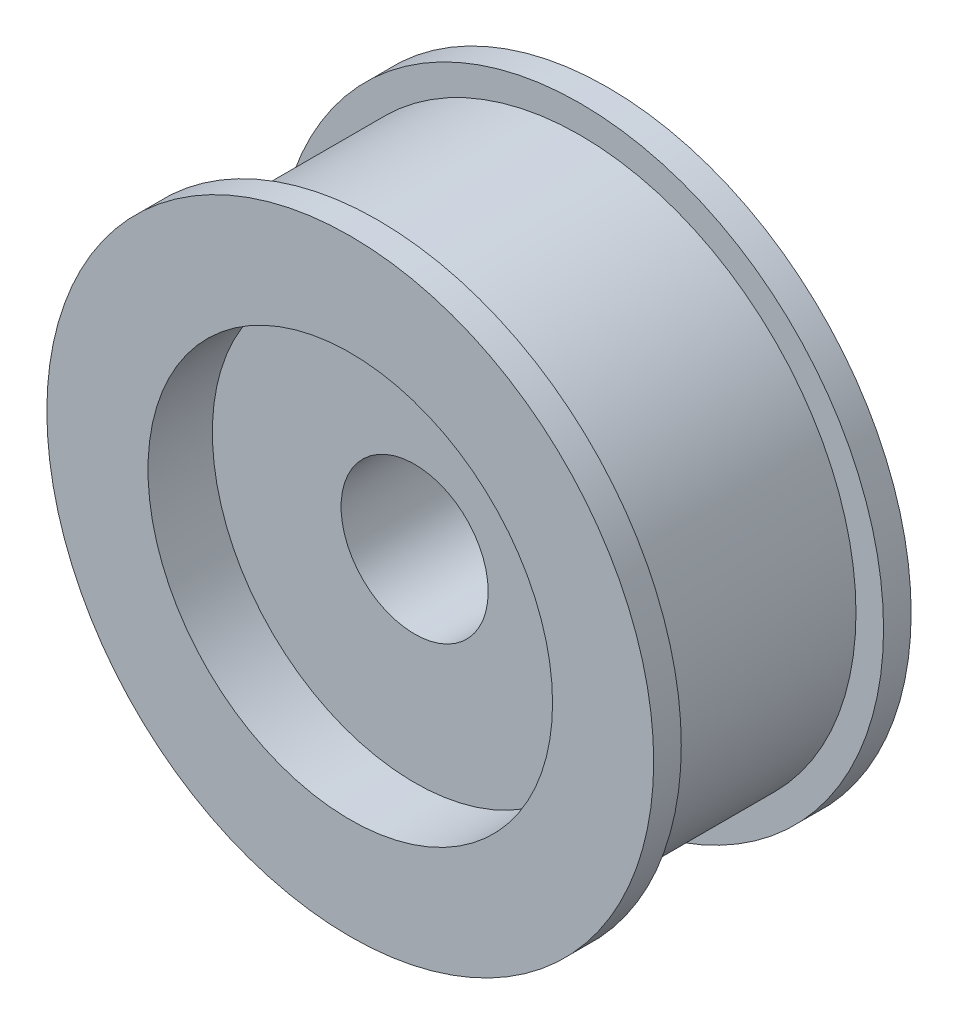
ISO-10303-21;
HEADER;
FILE_DESCRIPTION(('STEP AP214'),'2;1');
FILE_NAME('part.step','',(''),(''),'','','');
FILE_SCHEMA(('AUTOMOTIVE_DESIGN { 1 0 10303 214 1 1 1 1 }'));
ENDSEC;
DATA;
#1=APPLICATION_CONTEXT('core data for automotive mechanical design processes');
#2=APPLICATION_PROTOCOL_DEFINITION('international standard','automotive_design',2000,#1);
#3=PRODUCT_CONTEXT('',#1,'mechanical');
#4=PRODUCT('Part','Part','',(#3));
#5=PRODUCT_RELATED_PRODUCT_CATEGORY('part','',(#4));
#6=PRODUCT_DEFINITION_FORMATION('','',#4);
#7=PRODUCT_DEFINITION_CONTEXT('part definition',#1,'design');
#8=PRODUCT_DEFINITION('design','',#6,#7);
#9=PRODUCT_DEFINITION_SHAPE('','',#8);
#10=(LENGTH_UNIT() NAMED_UNIT(*) SI_UNIT(.MILLI.,.METRE.));
#11=(NAMED_UNIT(*) PLANE_ANGLE_UNIT() SI_UNIT($,.RADIAN.));
#12=(NAMED_UNIT(*) SI_UNIT($,.STERADIAN.) SOLID_ANGLE_UNIT());
#13=UNCERTAINTY_MEASURE_WITH_UNIT(LENGTH_MEASURE(1.E-05),#10,'distance_accuracy_value','');
#14=(GEOMETRIC_REPRESENTATION_CONTEXT(3) GLOBAL_UNCERTAINTY_ASSIGNED_CONTEXT((#13)) GLOBAL_UNIT_ASSIGNED_CONTEXT((#10,
#11,#12)) REPRESENTATION_CONTEXT('',''));
#15=CARTESIAN_POINT('',(0.,0.,0.));
#16=DIRECTION('',(0.,0.,1.));
#17=DIRECTION('',(1.,0.,0.));
#18=AXIS2_PLACEMENT_3D('',#15,#16,#17);
#19=CARTESIAN_POINT('',(0.,0.,23.3646380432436));
#20=DIRECTION('',(0.,0.,1.));
#21=DIRECTION('',(1.,0.,0.));
#22=AXIS2_PLACEMENT_3D('',#19,#20,#21);
#23=CYLINDRICAL_SURFACE('',#22,9.);
#24=CARTESIAN_POINT('',(0.,0.,-7.));
#25=DIRECTION('',(0.,0.,1.));
#26=DIRECTION('',(1.,0.,0.));
#27=AXIS2_PLACEMENT_3D('',#24,#25,#26);
#28=CIRCLE('',#27,9.);
#29=CARTESIAN_POINT('',(9.,0.,-7.));
#30=VERTEX_POINT('',#29);
#31=EDGE_CURVE('E52',#30,#30,#28,.T.);
#32=ORIENTED_EDGE('',*,*,#31,.F.);
#33=EDGE_LOOP('',(#32));
#34=FACE_BOUND('',#33,.T.);
#35=CARTESIAN_POINT('',(0.,0.,-3.5));
#36=DIRECTION('',(0.,0.,1.));
#37=DIRECTION('',(1.,0.,0.));
#38=AXIS2_PLACEMENT_3D('',#35,#36,#37);
#39=CIRCLE('',#38,9.);
#40=CARTESIAN_POINT('',(9.,0.,-3.5));
#41=VERTEX_POINT('',#40);
#42=EDGE_CURVE('E8',#41,#41,#39,.T.);
#43=ORIENTED_EDGE('',*,*,#42,.T.);
#44=EDGE_LOOP('',(#43));
#45=FACE_BOUND('',#44,.T.);
#46=ADVANCED_FACE('F12',(#34,#45),#23,.F.);
#47=CARTESIAN_POINT('',(0.,4.,-3.5));
#48=DIRECTION('',(0.,0.,1.));
#49=DIRECTION('',(1.,0.,0.));
#50=AXIS2_PLACEMENT_3D('',#47,#48,#49);
#51=PLANE('',#50);
#52=ORIENTED_EDGE('',*,*,#42,.F.);
#53=EDGE_LOOP('',(#52));
#54=FACE_BOUND('',#53,.T.);
#55=CARTESIAN_POINT('',(0.,0.,-3.5));
#56=DIRECTION('',(0.,0.,1.));
#57=DIRECTION('',(1.,0.,0.));
#58=AXIS2_PLACEMENT_3D('',#55,#56,#57);
#59=CIRCLE('',#58,4.);
#60=CARTESIAN_POINT('',(4.,0.,-3.5));
#61=VERTEX_POINT('',#60);
#62=EDGE_CURVE('E18',#61,#61,#59,.T.);
#63=ORIENTED_EDGE('',*,*,#62,.T.);
#64=EDGE_LOOP('',(#63));
#65=FACE_BOUND('',#64,.T.);
#66=ADVANCED_FACE('F59',(#54,#65),#51,.F.);
#67=CARTESIAN_POINT('',(0.,0.,23.3646380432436));
#68=DIRECTION('',(0.,0.,1.));
#69=DIRECTION('',(1.,0.,0.));
#70=AXIS2_PLACEMENT_3D('',#67,#68,#69);
#71=CYLINDRICAL_SURFACE('',#70,4.);
#72=ORIENTED_EDGE('',*,*,#62,.F.);
#73=EDGE_LOOP('',(#72));
#74=FACE_BOUND('',#73,.T.);
#75=CARTESIAN_POINT('',(0.,0.,3.5));
#76=DIRECTION('',(0.,0.,1.));
#77=DIRECTION('',(1.,0.,0.));
#78=AXIS2_PLACEMENT_3D('',#75,#76,#77);
#79=CIRCLE('',#78,4.);
#80=CARTESIAN_POINT('',(4.,0.,3.5));
#81=VERTEX_POINT('',#80);
#82=EDGE_CURVE('E22',#81,#81,#79,.T.);
#83=ORIENTED_EDGE('',*,*,#82,.T.);
#84=EDGE_LOOP('',(#83));
#85=FACE_BOUND('',#84,.T.);
#86=ADVANCED_FACE('F65',(#74,#85),#71,.F.);
#87=CARTESIAN_POINT('',(0.,11.,3.5));
#88=DIRECTION('',(0.,0.,-1.));
#89=DIRECTION('',(-1.,0.,0.));
#90=AXIS2_PLACEMENT_3D('',#87,#88,#89);
#91=PLANE('',#90);
#92=ORIENTED_EDGE('',*,*,#82,.F.);
#93=EDGE_LOOP('',(#92));
#94=FACE_BOUND('',#93,.T.);
#95=CARTESIAN_POINT('',(0.,0.,3.5));
#96=DIRECTION('',(0.,0.,1.));
#97=DIRECTION('',(1.,0.,0.));
#98=AXIS2_PLACEMENT_3D('',#95,#96,#97);
#99=CIRCLE('',#98,11.);
#100=CARTESIAN_POINT('',(11.,0.,3.5));
#101=VERTEX_POINT('',#100);
#102=EDGE_CURVE('E26',#101,#101,#99,.T.);
#103=ORIENTED_EDGE('',*,*,#102,.T.);
#104=EDGE_LOOP('',(#103));
#105=FACE_BOUND('',#104,.T.);
#106=ADVANCED_FACE('F71',(#94,#105),#91,.F.);
#107=CARTESIAN_POINT('',(0.,0.,23.3646380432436));
#108=DIRECTION('',(0.,0.,1.));
#109=DIRECTION('',(1.,0.,0.));
#110=AXIS2_PLACEMENT_3D('',#107,#108,#109);
#111=CYLINDRICAL_SURFACE('',#110,11.);
#112=ORIENTED_EDGE('',*,*,#102,.F.);
#113=EDGE_LOOP('',(#112));
#114=FACE_BOUND('',#113,.T.);
#115=CARTESIAN_POINT('',(0.,0.,7.));
#116=DIRECTION('',(0.,0.,1.));
#117=DIRECTION('',(1.,0.,0.));
#118=AXIS2_PLACEMENT_3D('',#115,#116,#117);
#119=CIRCLE('',#118,11.);
#120=CARTESIAN_POINT('',(11.,0.,7.));
#121=VERTEX_POINT('',#120);
#122=EDGE_CURVE('E31',#121,#121,#119,.T.);
#123=ORIENTED_EDGE('',*,*,#122,.T.);
#124=EDGE_LOOP('',(#123));
#125=FACE_BOUND('',#124,.T.);
#126=ADVANCED_FACE('F77',(#114,#125),#111,.F.);
#127=CARTESIAN_POINT('',(0.,16.5,7.));
#128=DIRECTION('',(0.,0.,-1.));
#129=DIRECTION('',(-1.,0.,0.));
#130=AXIS2_PLACEMENT_3D('',#127,#128,#129);
#131=PLANE('',#130);
#132=ORIENTED_EDGE('',*,*,#122,.F.);
#133=EDGE_LOOP('',(#132));
#134=FACE_BOUND('',#133,.T.);
#135=CARTESIAN_POINT('',(0.,0.,7.));
#136=DIRECTION('',(0.,0.,1.));
#137=DIRECTION('',(1.,0.,0.));
#138=AXIS2_PLACEMENT_3D('',#135,#136,#137);
#139=CIRCLE('',#138,16.5);
#140=CARTESIAN_POINT('',(16.5,0.,7.));
#141=VERTEX_POINT('',#140);
#142=EDGE_CURVE('E34',#141,#141,#139,.T.);
#143=ORIENTED_EDGE('',*,*,#142,.T.);
#144=EDGE_LOOP('',(#143));
#145=FACE_BOUND('',#144,.T.);
#146=ADVANCED_FACE('F81',(#134,#145),#131,.F.);
#147=CARTESIAN_POINT('',(0.,0.,23.3646380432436));
#148=DIRECTION('',(0.,0.,1.));
#149=DIRECTION('',(1.,0.,0.));
#150=AXIS2_PLACEMENT_3D('',#147,#148,#149);
#151=CYLINDRICAL_SURFACE('',#150,16.5);
#152=ORIENTED_EDGE('',*,*,#142,.F.);
#153=EDGE_LOOP('',(#152));
#154=FACE_BOUND('',#153,.T.);
#155=CARTESIAN_POINT('',(0.,0.,5.5));
#156=DIRECTION('',(0.,0.,1.));
#157=DIRECTION('',(1.,0.,0.));
#158=AXIS2_PLACEMENT_3D('',#155,#156,#157);
#159=CIRCLE('',#158,16.5);
#160=CARTESIAN_POINT('',(16.5,0.,5.5));
#161=VERTEX_POINT('',#160);
#162=EDGE_CURVE('E37',#161,#161,#159,.T.);
#163=ORIENTED_EDGE('',*,*,#162,.T.);
#164=EDGE_LOOP('',(#163));
#165=FACE_BOUND('',#164,.T.);
#166=ADVANCED_FACE('F85',(#154,#165),#151,.T.);
#167=CARTESIAN_POINT('',(0.,15.,5.5));
#168=DIRECTION('',(0.,0.,1.));
#169=DIRECTION('',(1.,0.,0.));
#170=AXIS2_PLACEMENT_3D('',#167,#168,#169);
#171=PLANE('',#170);
#172=ORIENTED_EDGE('',*,*,#162,.F.);
#173=EDGE_LOOP('',(#172));
#174=FACE_BOUND('',#173,.T.);
#175=CARTESIAN_POINT('',(0.,0.,5.5));
#176=DIRECTION('',(0.,0.,1.));
#177=DIRECTION('',(1.,0.,0.));
#178=AXIS2_PLACEMENT_3D('',#175,#176,#177);
#179=CIRCLE('',#178,15.);
#180=CARTESIAN_POINT('',(15.,0.,5.5));
#181=VERTEX_POINT('',#180);
#182=EDGE_CURVE('E40',#181,#181,#179,.T.);
#183=ORIENTED_EDGE('',*,*,#182,.T.);
#184=EDGE_LOOP('',(#183));
#185=FACE_BOUND('',#184,.T.);
#186=ADVANCED_FACE('F89',(#174,#185),#171,.F.);
#187=CARTESIAN_POINT('',(0.,0.,23.3646380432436));
#188=DIRECTION('',(0.,0.,1.));
#189=DIRECTION('',(1.,0.,0.));
#190=AXIS2_PLACEMENT_3D('',#187,#188,#189);
#191=CYLINDRICAL_SURFACE('',#190,15.);
#192=ORIENTED_EDGE('',*,*,#182,.F.);
#193=EDGE_LOOP('',(#192));
#194=FACE_BOUND('',#193,.T.);
#195=CARTESIAN_POINT('',(0.,0.,-5.5));
#196=DIRECTION('',(0.,0.,1.));
#197=DIRECTION('',(1.,0.,0.));
#198=AXIS2_PLACEMENT_3D('',#195,#196,#197);
#199=CIRCLE('',#198,15.);
#200=CARTESIAN_POINT('',(15.,0.,-5.5));
#201=VERTEX_POINT('',#200);
#202=EDGE_CURVE('E43',#201,#201,#199,.T.);
#203=ORIENTED_EDGE('',*,*,#202,.T.);
#204=EDGE_LOOP('',(#203));
#205=FACE_BOUND('',#204,.T.);
#206=ADVANCED_FACE('F93',(#194,#205),#191,.T.);
#207=CARTESIAN_POINT('',(0.,16.5,-5.5));
#208=DIRECTION('',(0.,0.,-1.));
#209=DIRECTION('',(-1.,0.,0.));
#210=AXIS2_PLACEMENT_3D('',#207,#208,#209);
#211=PLANE('',#210);
#212=ORIENTED_EDGE('',*,*,#202,.F.);
#213=EDGE_LOOP('',(#212));
#214=FACE_BOUND('',#213,.T.);
#215=CARTESIAN_POINT('',(0.,0.,-5.5));
#216=DIRECTION('',(0.,0.,1.));
#217=DIRECTION('',(1.,0.,0.));
#218=AXIS2_PLACEMENT_3D('',#215,#216,#217);
#219=CIRCLE('',#218,16.5);
#220=CARTESIAN_POINT('',(16.5,0.,-5.5));
#221=VERTEX_POINT('',#220);
#222=EDGE_CURVE('E46',#221,#221,#219,.T.);
#223=ORIENTED_EDGE('',*,*,#222,.T.);
#224=EDGE_LOOP('',(#223));
#225=FACE_BOUND('',#224,.T.);
#226=ADVANCED_FACE('F97',(#214,#225),#211,.F.);
#227=CARTESIAN_POINT('',(0.,0.,23.3646380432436));
#228=DIRECTION('',(0.,0.,1.));
#229=DIRECTION('',(1.,0.,0.));
#230=AXIS2_PLACEMENT_3D('',#227,#228,#229);
#231=CYLINDRICAL_SURFACE('',#230,16.5);
#232=ORIENTED_EDGE('',*,*,#222,.F.);
#233=EDGE_LOOP('',(#232));
#234=FACE_BOUND('',#233,.T.);
#235=CARTESIAN_POINT('',(0.,0.,-7.));
#236=DIRECTION('',(0.,0.,1.));
#237=DIRECTION('',(1.,0.,0.));
#238=AXIS2_PLACEMENT_3D('',#235,#236,#237);
#239=CIRCLE('',#238,16.5);
#240=CARTESIAN_POINT('',(16.5,0.,-7.));
#241=VERTEX_POINT('',#240);
#242=EDGE_CURVE('E49',#241,#241,#239,.T.);
#243=ORIENTED_EDGE('',*,*,#242,.T.);
#244=EDGE_LOOP('',(#243));
#245=FACE_BOUND('',#244,.T.);
#246=ADVANCED_FACE('F101',(#234,#245),#231,.T.);
#247=CARTESIAN_POINT('',(0.,9.,-7.));
#248=DIRECTION('',(0.,0.,1.));
#249=DIRECTION('',(1.,0.,0.));
#250=AXIS2_PLACEMENT_3D('',#247,#248,#249);
#251=PLANE('',#250);
#252=ORIENTED_EDGE('',*,*,#242,.F.);
#253=EDGE_LOOP('',(#252));
#254=FACE_BOUND('',#253,.T.);
#255=ORIENTED_EDGE('',*,*,#31,.T.);
#256=EDGE_LOOP('',(#255));
#257=FACE_BOUND('',#256,.T.);
#258=ADVANCED_FACE('F56',(#254,#257),#251,.F.);
#259=CLOSED_SHELL('',(#46,#66,#86,#106,#126,#146,#166,#186,#206,#226,#246,#258));
#260=MANIFOLD_SOLID_BREP('B1',#259);
#261=ADVANCED_BREP_SHAPE_REPRESENTATION('',(#18,#260),#14);
#262=SHAPE_DEFINITION_REPRESENTATION(#9,#261);
ENDSEC;
END-ISO-10303-21;
